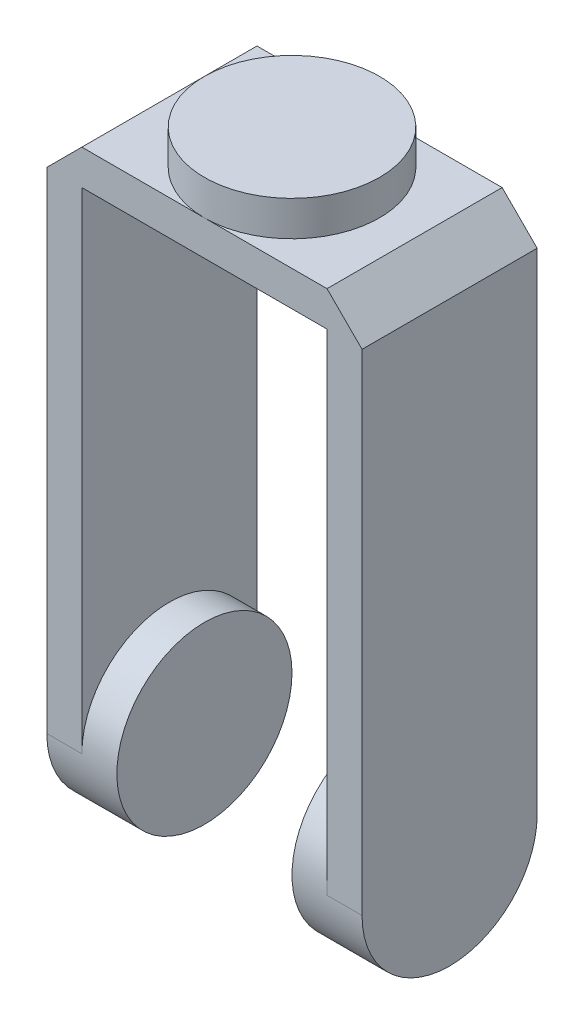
ISO-10303-21;
HEADER;
FILE_DESCRIPTION(('STEP AP214'),'2;1');
FILE_NAME('part.step','',(''),(''),'','','');
FILE_SCHEMA(('AUTOMOTIVE_DESIGN { 1 0 10303 214 1 1 1 1 }'));
ENDSEC;
DATA;
#1=APPLICATION_CONTEXT('core data for automotive mechanical design processes');
#2=APPLICATION_PROTOCOL_DEFINITION('international standard','automotive_design',2000,#1);
#3=PRODUCT_CONTEXT('',#1,'mechanical');
#4=PRODUCT('Part','Part','',(#3));
#5=PRODUCT_RELATED_PRODUCT_CATEGORY('part','',(#4));
#6=PRODUCT_DEFINITION_FORMATION('','',#4);
#7=PRODUCT_DEFINITION_CONTEXT('part definition',#1,'design');
#8=PRODUCT_DEFINITION('design','',#6,#7);
#9=PRODUCT_DEFINITION_SHAPE('','',#8);
#10=(LENGTH_UNIT() NAMED_UNIT(*) SI_UNIT(.MILLI.,.METRE.));
#11=(NAMED_UNIT(*) PLANE_ANGLE_UNIT() SI_UNIT($,.RADIAN.));
#12=(NAMED_UNIT(*) SI_UNIT($,.STERADIAN.) SOLID_ANGLE_UNIT());
#13=UNCERTAINTY_MEASURE_WITH_UNIT(LENGTH_MEASURE(1.E-05),#10,'distance_accuracy_value','');
#14=(GEOMETRIC_REPRESENTATION_CONTEXT(3) GLOBAL_UNCERTAINTY_ASSIGNED_CONTEXT((#13)) GLOBAL_UNIT_ASSIGNED_CONTEXT((#10,
#11,#12)) REPRESENTATION_CONTEXT('',''));
#15=CARTESIAN_POINT('',(0.,0.,0.));
#16=DIRECTION('',(0.,0.,1.));
#17=DIRECTION('',(1.,0.,0.));
#18=AXIS2_PLACEMENT_3D('',#15,#16,#17);
#19=CARTESIAN_POINT('',(35.,0.,-25.));
#20=DIRECTION('',(-1.,0.,0.));
#21=DIRECTION('',(0.,-1.,0.));
#22=AXIS2_PLACEMENT_3D('',#19,#20,#21);
#23=PLANE('',#22);
#24=DIRECTION('',(0.,-1.,0.));
#25=VECTOR('',#24,1.);
#26=CARTESIAN_POINT('',(35.,0.,-25.));
#27=LINE('',#26,#25);
#28=CARTESIAN_POINT('',(35.,-20.,-25.));
#29=VERTEX_POINT('',#28);
#30=CARTESIAN_POINT('',(35.,-160.,-25.));
#31=VERTEX_POINT('',#30);
#32=EDGE_CURVE('E193',#29,#31,#27,.T.);
#33=ORIENTED_EDGE('',*,*,#32,.T.);
#34=CARTESIAN_POINT('',(35.,-160.,0.));
#35=DIRECTION('',(-1.,0.,0.));
#36=DIRECTION('',(0.,-1.,0.));
#37=AXIS2_PLACEMENT_3D('',#34,#35,#36);
#38=CIRCLE('',#37,25.);
#39=CARTESIAN_POINT('',(35.,-160.,25.));
#40=VERTEX_POINT('',#39);
#41=EDGE_CURVE('E184',#40,#31,#38,.T.);
#42=ORIENTED_EDGE('',*,*,#41,.F.);
#43=DIRECTION('',(0.,-1.,0.));
#44=VECTOR('',#43,1.);
#45=CARTESIAN_POINT('',(35.,0.,25.));
#46=LINE('',#45,#44);
#47=CARTESIAN_POINT('',(35.,-20.,25.));
#48=VERTEX_POINT('',#47);
#49=EDGE_CURVE('E167',#48,#40,#46,.T.);
#50=ORIENTED_EDGE('',*,*,#49,.F.);
#51=DIRECTION('',(0.,0.,1.));
#52=VECTOR('',#51,1.);
#53=CARTESIAN_POINT('',(35.,-20.,-25.));
#54=LINE('',#53,#52);
#55=EDGE_CURVE('E84',#29,#48,#54,.T.);
#56=ORIENTED_EDGE('',*,*,#55,.F.);
#57=EDGE_LOOP('',(#33,#42,#50,#56));
#58=FACE_BOUND('',#57,.T.);
#59=ADVANCED_FACE('F80',(#58),#23,.T.);
#60=CARTESIAN_POINT('',(-35.,0.,-25.));
#61=DIRECTION('',(-1.,0.,0.));
#62=DIRECTION('',(0.,-1.,0.));
#63=AXIS2_PLACEMENT_3D('',#60,#61,#62);
#64=PLANE('',#63);
#65=CARTESIAN_POINT('',(-35.,-160.,0.));
#66=DIRECTION('',(1.,0.,0.));
#67=DIRECTION('',(0.,1.,0.));
#68=AXIS2_PLACEMENT_3D('',#65,#66,#67);
#69=CIRCLE('',#68,25.);
#70=CARTESIAN_POINT('',(-35.,-160.,-25.));
#71=VERTEX_POINT('',#70);
#72=CARTESIAN_POINT('',(-35.,-160.,25.));
#73=VERTEX_POINT('',#72);
#74=EDGE_CURVE('E199',#71,#73,#69,.T.);
#75=ORIENTED_EDGE('',*,*,#74,.F.);
#76=DIRECTION('',(0.,-1.,0.));
#77=VECTOR('',#76,1.);
#78=CARTESIAN_POINT('',(-35.,0.,-25.));
#79=LINE('',#78,#77);
#80=CARTESIAN_POINT('',(-35.,-20.,-25.));
#81=VERTEX_POINT('',#80);
#82=EDGE_CURVE('E278',#81,#71,#79,.T.);
#83=ORIENTED_EDGE('',*,*,#82,.F.);
#84=DIRECTION('',(0.,0.,1.));
#85=VECTOR('',#84,1.);
#86=CARTESIAN_POINT('',(-35.,-20.,-25.));
#87=LINE('',#86,#85);
#88=CARTESIAN_POINT('',(-35.,-20.,25.));
#89=VERTEX_POINT('',#88);
#90=EDGE_CURVE('E12',#81,#89,#87,.T.);
#91=ORIENTED_EDGE('',*,*,#90,.T.);
#92=DIRECTION('',(0.,-1.,0.));
#93=VECTOR('',#92,1.);
#94=CARTESIAN_POINT('',(-35.,0.,25.));
#95=LINE('',#94,#93);
#96=EDGE_CURVE('E251',#89,#73,#95,.T.);
#97=ORIENTED_EDGE('',*,*,#96,.T.);
#98=EDGE_LOOP('',(#75,#83,#91,#97));
#99=FACE_BOUND('',#98,.T.);
#100=ADVANCED_FACE('F329',(#99),#64,.F.);
#101=CARTESIAN_POINT('',(-45.,0.,-25.));
#102=DIRECTION('',(-1.,0.,0.));
#103=DIRECTION('',(0.,-1.,0.));
#104=AXIS2_PLACEMENT_3D('',#101,#102,#103);
#105=PLANE('',#104);
#106=CARTESIAN_POINT('',(-45.,-160.,0.));
#107=DIRECTION('',(-1.,0.,0.));
#108=DIRECTION('',(0.,-1.,0.));
#109=AXIS2_PLACEMENT_3D('',#106,#107,#108);
#110=CIRCLE('',#109,25.);
#111=CARTESIAN_POINT('',(-45.,-160.,-25.));
#112=VERTEX_POINT('',#111);
#113=CARTESIAN_POINT('',(-45.,-160.,25.));
#114=VERTEX_POINT('',#113);
#115=EDGE_CURVE('E188',#112,#114,#110,.T.);
#116=ORIENTED_EDGE('',*,*,#115,.T.);
#117=DIRECTION('',(0.,-1.,0.));
#118=VECTOR('',#117,1.);
#119=CARTESIAN_POINT('',(-45.,0.,25.));
#120=LINE('',#119,#118);
#121=CARTESIAN_POINT('',(-45.,-20.,25.));
#122=VERTEX_POINT('',#121);
#123=EDGE_CURVE('E247',#122,#114,#120,.T.);
#124=ORIENTED_EDGE('',*,*,#123,.F.);
#125=DIRECTION('',(0.,0.,1.));
#126=VECTOR('',#125,1.);
#127=CARTESIAN_POINT('',(-45.,-20.,-25.));
#128=LINE('',#127,#126);
#129=CARTESIAN_POINT('',(-45.,-20.,-25.));
#130=VERTEX_POINT('',#129);
#131=EDGE_CURVE('E90',#130,#122,#128,.T.);
#132=ORIENTED_EDGE('',*,*,#131,.F.);
#133=DIRECTION('',(0.,-1.,0.));
#134=VECTOR('',#133,1.);
#135=CARTESIAN_POINT('',(-45.,0.,-25.));
#136=LINE('',#135,#134);
#137=EDGE_CURVE('E274',#130,#112,#136,.T.);
#138=ORIENTED_EDGE('',*,*,#137,.T.);
#139=EDGE_LOOP('',(#116,#124,#132,#138));
#140=FACE_BOUND('',#139,.T.);
#141=ADVANCED_FACE('F333',(#140),#105,.T.);
#142=CARTESIAN_POINT('',(45.,0.,-25.));
#143=DIRECTION('',(-1.,0.,0.));
#144=DIRECTION('',(0.,0.,1.));
#145=AXIS2_PLACEMENT_3D('',#142,#143,#144);
#146=PLANE('',#145);
#147=DIRECTION('',(0.,-1.,0.));
#148=VECTOR('',#147,1.);
#149=CARTESIAN_POINT('',(45.,0.,25.));
#150=LINE('',#149,#148);
#151=CARTESIAN_POINT('',(45.,-20.,25.));
#152=VERTEX_POINT('',#151);
#153=CARTESIAN_POINT('',(45.,-160.,25.));
#154=VERTEX_POINT('',#153);
#155=EDGE_CURVE('E178',#152,#154,#150,.T.);
#156=ORIENTED_EDGE('',*,*,#155,.T.);
#157=CARTESIAN_POINT('',(45.,-160.,0.));
#158=DIRECTION('',(-1.,0.,0.));
#159=DIRECTION('',(0.,0.,1.));
#160=AXIS2_PLACEMENT_3D('',#157,#158,#159);
#161=CIRCLE('',#160,25.);
#162=CARTESIAN_POINT('',(45.,-160.,-25.));
#163=VERTEX_POINT('',#162);
#164=EDGE_CURVE('E186',#163,#154,#161,.T.);
#165=ORIENTED_EDGE('',*,*,#164,.F.);
#166=DIRECTION('',(0.,-1.,0.));
#167=VECTOR('',#166,1.);
#168=CARTESIAN_POINT('',(45.,0.,-25.));
#169=LINE('',#168,#167);
#170=CARTESIAN_POINT('',(45.,-20.,-25.));
#171=VERTEX_POINT('',#170);
#172=EDGE_CURVE('E260',#171,#163,#169,.T.);
#173=ORIENTED_EDGE('',*,*,#172,.F.);
#174=DIRECTION('',(0.,0.,1.));
#175=VECTOR('',#174,1.);
#176=CARTESIAN_POINT('',(45.,-20.,-25.));
#177=LINE('',#176,#175);
#178=EDGE_CURVE('E289',#171,#152,#177,.T.);
#179=ORIENTED_EDGE('',*,*,#178,.T.);
#180=EDGE_LOOP('',(#156,#165,#173,#179));
#181=FACE_BOUND('',#180,.T.);
#182=ADVANCED_FACE('F337',(#181),#146,.F.);
#183=CARTESIAN_POINT('',(0.,0.,-25.));
#184=DIRECTION('',(0.,-1.,0.));
#185=DIRECTION('',(1.,0.,0.));
#186=AXIS2_PLACEMENT_3D('',#183,#184,#185);
#187=PLANE('',#186);
#188=CARTESIAN_POINT('',(0.,0.,0.));
#189=DIRECTION('',(0.,1.,0.));
#190=DIRECTION('',(-1.,0.,0.));
#191=AXIS2_PLACEMENT_3D('',#188,#189,#190);
#192=CIRCLE('',#191,25.);
#193=CARTESIAN_POINT('',(-25.,0.,0.));
#194=VERTEX_POINT('',#193);
#195=EDGE_CURVE('E219',#194,#194,#192,.T.);
#196=ORIENTED_EDGE('',*,*,#195,.T.);
#197=EDGE_LOOP('',(#196));
#198=FACE_BOUND('',#197,.T.);
#199=ADVANCED_FACE('F339',(#198),#187,.F.);
#200=CARTESIAN_POINT('',(0.,0.,25.));
#201=DIRECTION('',(0.,0.,1.));
#202=DIRECTION('',(1.,0.,0.));
#203=AXIS2_PLACEMENT_3D('',#200,#201,#202);
#204=PLANE('',#203);
#205=DIRECTION('',(-1.,0.,0.));
#206=VECTOR('',#205,1.);
#207=CARTESIAN_POINT('',(62.0000000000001,-160.,25.));
#208=LINE('',#207,#206);
#209=EDGE_CURVE('E171',#154,#40,#208,.T.);
#210=ORIENTED_EDGE('',*,*,#209,.F.);
#211=ORIENTED_EDGE('',*,*,#155,.F.);
#212=DIRECTION('',(-0.707106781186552,0.707106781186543,0.));
#213=VECTOR('',#212,1.);
#214=CARTESIAN_POINT('',(12.4999999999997,12.4999999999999,25.));
#215=LINE('',#214,#213);
#216=CARTESIAN_POINT('',(34.9999999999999,-10.,25.));
#217=VERTEX_POINT('',#216);
#218=EDGE_CURVE('E234',#152,#217,#215,.T.);
#219=ORIENTED_EDGE('',*,*,#218,.T.);
#220=DIRECTION('',(1.,0.,0.));
#221=VECTOR('',#220,1.);
#222=CARTESIAN_POINT('',(0.,-10.,25.));
#223=LINE('',#222,#221);
#224=CARTESIAN_POINT('',(0.,-10.,25.));
#225=VERTEX_POINT('',#224);
#226=EDGE_CURVE('E238',#225,#217,#223,.T.);
#227=ORIENTED_EDGE('',*,*,#226,.F.);
#228=CARTESIAN_POINT('',(-35.,-10.,25.));
#229=VERTEX_POINT('',#228);
#230=EDGE_CURVE('E242',#229,#225,#223,.T.);
#231=ORIENTED_EDGE('',*,*,#230,.F.);
#232=DIRECTION('',(0.707106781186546,0.707106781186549,0.));
#233=VECTOR('',#232,1.);
#234=CARTESIAN_POINT('',(-12.5000000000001,12.5,25.));
#235=LINE('',#234,#233);
#236=EDGE_CURVE('E243',#122,#229,#235,.T.);
#237=ORIENTED_EDGE('',*,*,#236,.F.);
#238=ORIENTED_EDGE('',*,*,#123,.T.);
#239=EDGE_CURVE('E189',#73,#114,#208,.T.);
#240=ORIENTED_EDGE('',*,*,#239,.F.);
#241=ORIENTED_EDGE('',*,*,#96,.F.);
#242=DIRECTION('',(1.,0.,0.));
#243=VECTOR('',#242,1.);
#244=CARTESIAN_POINT('',(0.,-20.,25.));
#245=LINE('',#244,#243);
#246=EDGE_CURVE('E174',#89,#48,#245,.T.);
#247=ORIENTED_EDGE('',*,*,#246,.T.);
#248=ORIENTED_EDGE('',*,*,#49,.T.);
#249=EDGE_LOOP('',(#210,#211,#219,#227,#231,#237,#238,#240,#241,#247,#248));
#250=FACE_BOUND('',#249,.T.);
#251=ADVANCED_FACE('F169',(#250),#204,.T.);
#252=CARTESIAN_POINT('',(0.,0.,-25.));
#253=DIRECTION('',(0.,0.,1.));
#254=DIRECTION('',(1.,0.,0.));
#255=AXIS2_PLACEMENT_3D('',#252,#253,#254);
#256=PLANE('',#255);
#257=ORIENTED_EDGE('',*,*,#172,.T.);
#258=DIRECTION('',(-1.,0.,0.));
#259=VECTOR('',#258,1.);
#260=CARTESIAN_POINT('',(62.0000000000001,-160.,-25.));
#261=LINE('',#260,#259);
#262=EDGE_CURVE('E216',#163,#31,#261,.T.);
#263=ORIENTED_EDGE('',*,*,#262,.T.);
#264=ORIENTED_EDGE('',*,*,#32,.F.);
#265=DIRECTION('',(1.,0.,0.));
#266=VECTOR('',#265,1.);
#267=CARTESIAN_POINT('',(0.,-20.,-25.));
#268=LINE('',#267,#266);
#269=EDGE_CURVE('E255',#81,#29,#268,.T.);
#270=ORIENTED_EDGE('',*,*,#269,.F.);
#271=ORIENTED_EDGE('',*,*,#82,.T.);
#272=EDGE_CURVE('E212',#71,#112,#261,.T.);
#273=ORIENTED_EDGE('',*,*,#272,.T.);
#274=ORIENTED_EDGE('',*,*,#137,.F.);
#275=DIRECTION('',(0.707106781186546,0.707106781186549,0.));
#276=VECTOR('',#275,1.);
#277=CARTESIAN_POINT('',(-12.5000000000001,12.5,-25.));
#278=LINE('',#277,#276);
#279=CARTESIAN_POINT('',(-35.,-10.,-25.));
#280=VERTEX_POINT('',#279);
#281=EDGE_CURVE('E271',#130,#280,#278,.T.);
#282=ORIENTED_EDGE('',*,*,#281,.T.);
#283=DIRECTION('',(1.,0.,0.));
#284=VECTOR('',#283,1.);
#285=CARTESIAN_POINT('',(0.,-10.,-25.));
#286=LINE('',#285,#284);
#287=CARTESIAN_POINT('',(0.,-10.,-25.));
#288=VERTEX_POINT('',#287);
#289=EDGE_CURVE('E270',#280,#288,#286,.T.);
#290=ORIENTED_EDGE('',*,*,#289,.T.);
#291=CARTESIAN_POINT('',(34.9999999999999,-10.,-25.));
#292=VERTEX_POINT('',#291);
#293=EDGE_CURVE('E98',#288,#292,#286,.T.);
#294=ORIENTED_EDGE('',*,*,#293,.T.);
#295=DIRECTION('',(-0.707106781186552,0.707106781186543,0.));
#296=VECTOR('',#295,1.);
#297=CARTESIAN_POINT('',(12.4999999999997,12.4999999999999,-25.));
#298=LINE('',#297,#296);
#299=EDGE_CURVE('E264',#171,#292,#298,.T.);
#300=ORIENTED_EDGE('',*,*,#299,.F.);
#301=EDGE_LOOP('',(#257,#263,#264,#270,#271,#273,#274,#282,#290,#294,#300));
#302=FACE_BOUND('',#301,.T.);
#303=ADVANCED_FACE('F297',(#302),#256,.F.);
#304=CARTESIAN_POINT('',(0.,-20.,-25.));
#305=DIRECTION('',(0.,-1.,0.));
#306=DIRECTION('',(1.,0.,0.));
#307=AXIS2_PLACEMENT_3D('',#304,#305,#306);
#308=PLANE('',#307);
#309=ORIENTED_EDGE('',*,*,#55,.T.);
#310=ORIENTED_EDGE('',*,*,#246,.F.);
#311=ORIENTED_EDGE('',*,*,#90,.F.);
#312=ORIENTED_EDGE('',*,*,#269,.T.);
#313=EDGE_LOOP('',(#309,#310,#311,#312));
#314=FACE_BOUND('',#313,.T.);
#315=ADVANCED_FACE('F82',(#314),#308,.T.);
#316=CARTESIAN_POINT('',(-12.5000000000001,12.5,-25.));
#317=DIRECTION('',(0.707106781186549,-0.707106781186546,0.));
#318=DIRECTION('',(0.707106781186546,0.707106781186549,0.));
#319=AXIS2_PLACEMENT_3D('',#316,#317,#318);
#320=PLANE('',#319);
#321=ORIENTED_EDGE('',*,*,#131,.T.);
#322=ORIENTED_EDGE('',*,*,#236,.T.);
#323=DIRECTION('',(0.,0.,1.));
#324=VECTOR('',#323,1.);
#325=CARTESIAN_POINT('',(-35.,-10.,-25.));
#326=LINE('',#325,#324);
#327=EDGE_CURVE('E284',#280,#229,#326,.T.);
#328=ORIENTED_EDGE('',*,*,#327,.F.);
#329=ORIENTED_EDGE('',*,*,#281,.F.);
#330=EDGE_LOOP('',(#321,#322,#328,#329));
#331=FACE_BOUND('',#330,.T.);
#332=ADVANCED_FACE('F325',(#331),#320,.F.);
#333=CARTESIAN_POINT('',(0.,-10.,-25.));
#334=DIRECTION('',(0.,-1.,0.));
#335=DIRECTION('',(1.,0.,0.));
#336=AXIS2_PLACEMENT_3D('',#333,#334,#335);
#337=PLANE('',#336);
#338=ORIENTED_EDGE('',*,*,#327,.T.);
#339=ORIENTED_EDGE('',*,*,#230,.T.);
#340=CARTESIAN_POINT('',(0.,-10.,0.));
#341=DIRECTION('',(0.,1.,0.));
#342=DIRECTION('',(-1.,0.,0.));
#343=AXIS2_PLACEMENT_3D('',#340,#341,#342);
#344=CIRCLE('',#343,25.);
#345=EDGE_CURVE('E223',#288,#225,#344,.T.);
#346=ORIENTED_EDGE('',*,*,#345,.F.);
#347=ORIENTED_EDGE('',*,*,#289,.F.);
#348=EDGE_LOOP('',(#338,#339,#346,#347));
#349=FACE_BOUND('',#348,.T.);
#350=ADVANCED_FACE('F309',(#349),#337,.F.);
#351=ORIENTED_EDGE('',*,*,#293,.F.);
#352=CARTESIAN_POINT('',(0.,-10.,0.));
#353=DIRECTION('',(0.,1.,0.));
#354=DIRECTION('',(-1.,0.,0.));
#355=AXIS2_PLACEMENT_3D('',#352,#353,#354);
#356=CIRCLE('',#355,25.);
#357=EDGE_CURVE('E220',#225,#288,#356,.T.);
#358=ORIENTED_EDGE('',*,*,#357,.F.);
#359=ORIENTED_EDGE('',*,*,#226,.T.);
#360=DIRECTION('',(0.,0.,1.));
#361=VECTOR('',#360,1.);
#362=CARTESIAN_POINT('',(34.9999999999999,-10.,-25.));
#363=LINE('',#362,#361);
#364=EDGE_CURVE('E287',#292,#217,#363,.T.);
#365=ORIENTED_EDGE('',*,*,#364,.F.);
#366=EDGE_LOOP('',(#351,#358,#359,#365));
#367=FACE_BOUND('',#366,.T.);
#368=ADVANCED_FACE('F315',(#367),#337,.F.);
#369=CARTESIAN_POINT('',(12.4999999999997,12.4999999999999,-25.));
#370=DIRECTION('',(0.707106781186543,0.707106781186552,0.));
#371=DIRECTION('',(-0.707106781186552,0.707106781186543,0.));
#372=AXIS2_PLACEMENT_3D('',#369,#370,#371);
#373=PLANE('',#372);
#374=ORIENTED_EDGE('',*,*,#364,.T.);
#375=ORIENTED_EDGE('',*,*,#218,.F.);
#376=ORIENTED_EDGE('',*,*,#178,.F.);
#377=ORIENTED_EDGE('',*,*,#299,.T.);
#378=EDGE_LOOP('',(#374,#375,#376,#377));
#379=FACE_BOUND('',#378,.T.);
#380=ADVANCED_FACE('F317',(#379),#373,.T.);
#381=CARTESIAN_POINT('',(0.,-10.,0.));
#382=DIRECTION('',(0.,1.,0.));
#383=DIRECTION('',(-1.,0.,0.));
#384=AXIS2_PLACEMENT_3D('',#381,#382,#383);
#385=CYLINDRICAL_SURFACE('',#384,25.);
#386=ORIENTED_EDGE('',*,*,#195,.F.);
#387=EDGE_LOOP('',(#386));
#388=FACE_BOUND('',#387,.T.);
#389=ORIENTED_EDGE('',*,*,#345,.T.);
#390=ORIENTED_EDGE('',*,*,#357,.T.);
#391=EDGE_LOOP('',(#389,#390));
#392=FACE_BOUND('',#391,.T.);
#393=ADVANCED_FACE('F313',(#388,#392),#385,.T.);
#394=CARTESIAN_POINT('',(62.0000000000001,-160.,0.));
#395=DIRECTION('',(-1.,0.,0.));
#396=DIRECTION('',(0.,-1.,0.));
#397=AXIS2_PLACEMENT_3D('',#394,#395,#396);
#398=CYLINDRICAL_SURFACE('',#397,25.);
#399=ORIENTED_EDGE('',*,*,#164,.T.);
#400=ORIENTED_EDGE('',*,*,#209,.T.);
#401=ORIENTED_EDGE('',*,*,#41,.T.);
#402=ORIENTED_EDGE('',*,*,#262,.F.);
#403=EDGE_LOOP('',(#399,#400,#401,#402));
#404=FACE_BOUND('',#403,.T.);
#405=CARTESIAN_POINT('',(25.,-160.,0.));
#406=DIRECTION('',(-1.,0.,0.));
#407=DIRECTION('',(0.,-1.,0.));
#408=AXIS2_PLACEMENT_3D('',#405,#406,#407);
#409=CIRCLE('',#408,25.);
#410=CARTESIAN_POINT('',(25.,-185.,0.));
#411=VERTEX_POINT('',#410);
#412=EDGE_CURVE('E195',#411,#411,#409,.T.);
#413=ORIENTED_EDGE('',*,*,#412,.F.);
#414=EDGE_LOOP('',(#413));
#415=FACE_BOUND('',#414,.T.);
#416=ADVANCED_FACE('F182',(#404,#415),#398,.T.);
#417=ORIENTED_EDGE('',*,*,#272,.F.);
#418=ORIENTED_EDGE('',*,*,#74,.T.);
#419=ORIENTED_EDGE('',*,*,#239,.T.);
#420=ORIENTED_EDGE('',*,*,#115,.F.);
#421=EDGE_LOOP('',(#417,#418,#419,#420));
#422=FACE_BOUND('',#421,.T.);
#423=CARTESIAN_POINT('',(-25.,-160.,0.));
#424=DIRECTION('',(1.,0.,0.));
#425=DIRECTION('',(0.,1.,0.));
#426=AXIS2_PLACEMENT_3D('',#423,#424,#425);
#427=CIRCLE('',#426,25.);
#428=CARTESIAN_POINT('',(-25.,-135.,0.));
#429=VERTEX_POINT('',#428);
#430=EDGE_CURVE('E202',#429,#429,#427,.T.);
#431=ORIENTED_EDGE('',*,*,#430,.F.);
#432=EDGE_LOOP('',(#431));
#433=FACE_BOUND('',#432,.T.);
#434=ADVANCED_FACE('F353',(#422,#433),#398,.T.);
#435=CARTESIAN_POINT('',(-25.,-160.,0.));
#436=DIRECTION('',(1.,0.,0.));
#437=DIRECTION('',(0.,1.,0.));
#438=AXIS2_PLACEMENT_3D('',#435,#436,#437);
#439=PLANE('',#438);
#440=ORIENTED_EDGE('',*,*,#430,.T.);
#441=EDGE_LOOP('',(#440));
#442=FACE_BOUND('',#441,.T.);
#443=ADVANCED_FACE('F372',(#442),#439,.T.);
#444=CARTESIAN_POINT('',(25.,-160.,0.));
#445=DIRECTION('',(-1.,0.,0.));
#446=DIRECTION('',(0.,-1.,0.));
#447=AXIS2_PLACEMENT_3D('',#444,#445,#446);
#448=PLANE('',#447);
#449=ORIENTED_EDGE('',*,*,#412,.T.);
#450=EDGE_LOOP('',(#449));
#451=FACE_BOUND('',#450,.T.);
#452=ADVANCED_FACE('F376',(#451),#448,.T.);
#453=CLOSED_SHELL('',(#59,#100,#141,#182,#199,#251,#303,#315,#332,#350,#368,#380,#393,#416,#434,
#443,#452));
#454=MANIFOLD_SOLID_BREP('B2',#453);
#455=ADVANCED_BREP_SHAPE_REPRESENTATION('',(#18,#454),#14);
#456=SHAPE_DEFINITION_REPRESENTATION(#9,#455);
ENDSEC;
END-ISO-10303-21;
